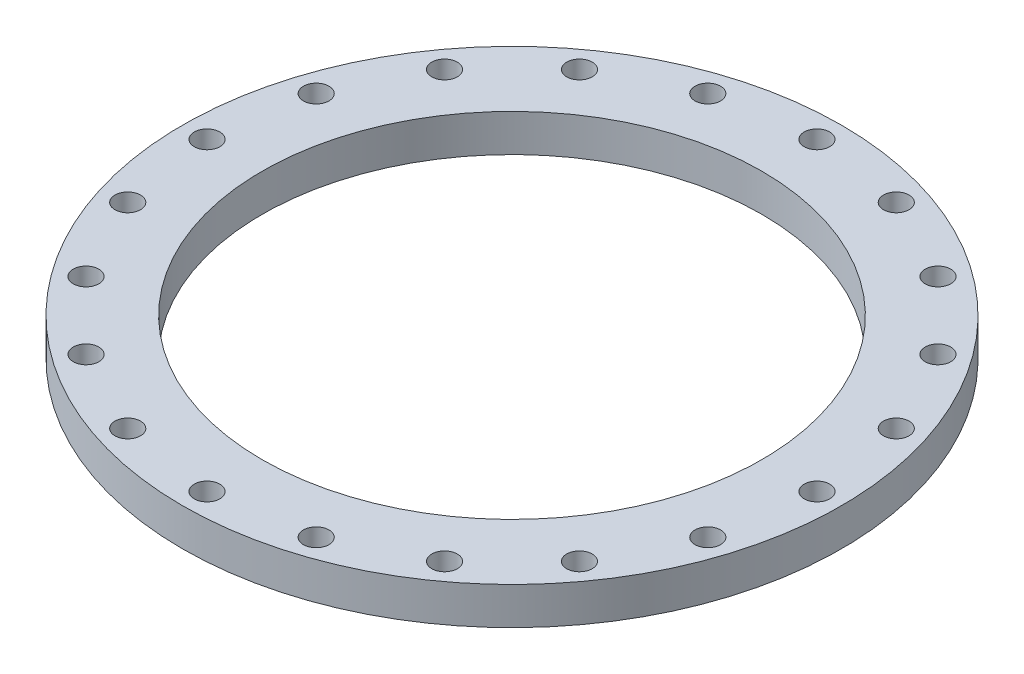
from build123d import *

# Parameters (mm, degrees)
ESQUISSE1_R        = 335
ESQUISSE1_R_2      = 13
ESQUISSE1_R_3      = 254
BOSS_EXTRU_1_DEPTH = 38


with BuildPart() as part:
    # Esquisse1 → Boss.-Extru.1 (new body)
    with BuildSketch(Plane(origin=(0, 38, 0), x_dir=(1, 0, 0), z_dir=(0, 1, 0))):
        with Locations(Location((0, 0, 0), (0, 0, 90))):
            Circle(ESQUISSE1_R)
        with Locations(Location((294.827520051, -95.795268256, 0), (0, 0, 90))):
            Circle(ESQUISSE1_R_2, mode=Mode.SUBTRACT)
        with Locations(Location((250.795268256, -182.213428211, 0), (0, 0, 90))):
            Circle(ESQUISSE1_R_2, mode=Mode.SUBTRACT)
        with Locations(Location((182.213428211, -250.795268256, 0), (0, 0, 90))):
            Circle(ESQUISSE1_R_2, mode=Mode.SUBTRACT)
        with Locations(Location((95.795268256, -294.827520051, 0), (0, 0, 90))):
            Circle(ESQUISSE1_R_2, mode=Mode.SUBTRACT)
        with Locations(Location((0, -310, 0), (0, 0, 90))):
            Circle(ESQUISSE1_R_2, mode=Mode.SUBTRACT)
        with Locations(Location((-95.795268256, -294.827520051, 0), (0, 0, 90))):
            Circle(ESQUISSE1_R_2, mode=Mode.SUBTRACT)
        with Locations(Location((-182.213428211, -250.795268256, 0), (0, 0, 90))):
            Circle(ESQUISSE1_R_2, mode=Mode.SUBTRACT)
        with Locations(Location((-250.795268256, -182.213428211, 0), (0, 0, 90))):
            Circle(ESQUISSE1_R_2, mode=Mode.SUBTRACT)
        with Locations(Location((-294.827520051, -95.795268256, 0), (0, 0, 90))):
            Circle(ESQUISSE1_R_2, mode=Mode.SUBTRACT)
        with Locations(Location((-310, 0, 0), (0, 0, 90))):
            Circle(ESQUISSE1_R_2, mode=Mode.SUBTRACT)
        with Locations(Location((-294.827520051, 95.795268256, 0), (0, 0, 90))):
            Circle(ESQUISSE1_R_2, mode=Mode.SUBTRACT)
        with Locations(Location((-250.795268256, 182.213428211, 0), (0, 0, 90))):
            Circle(ESQUISSE1_R_2, mode=Mode.SUBTRACT)
        with Locations(Location((-182.213428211, 250.795268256, 0), (0, 0, 90))):
            Circle(ESQUISSE1_R_2, mode=Mode.SUBTRACT)
        with Locations(Location((-95.795268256, 294.827520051, 0), (0, 0, 90))):
            Circle(ESQUISSE1_R_2, mode=Mode.SUBTRACT)
        with Locations(Location((0, 310, 0), (0, 0, 90))):
            Circle(ESQUISSE1_R_2, mode=Mode.SUBTRACT)
        with Locations(Location((95.795268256, 294.827520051, 0), (0, 0, 90))):
            Circle(ESQUISSE1_R_2, mode=Mode.SUBTRACT)
        with Locations(Location((182.213428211, 250.795268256, 0), (0, 0, 90))):
            Circle(ESQUISSE1_R_2, mode=Mode.SUBTRACT)
        with Locations(Location((250.795268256, 182.213428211, 0), (0, 0, 90))):
            Circle(ESQUISSE1_R_2, mode=Mode.SUBTRACT)
        with Locations(Location((294.827520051, 95.795268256, 0), (0, 0, 90))):
            Circle(ESQUISSE1_R_2, mode=Mode.SUBTRACT)
        with Locations(Location((310, 0, 0), (0, 0, 90))):
            Circle(ESQUISSE1_R_2, mode=Mode.SUBTRACT)
        with Locations(Location((0, 0, 0), (0, 0, 90))):
            Circle(ESQUISSE1_R_3, mode=Mode.SUBTRACT)
    extrude(amount=-BOSS_EXTRU_1_DEPTH)


solid = part.part
